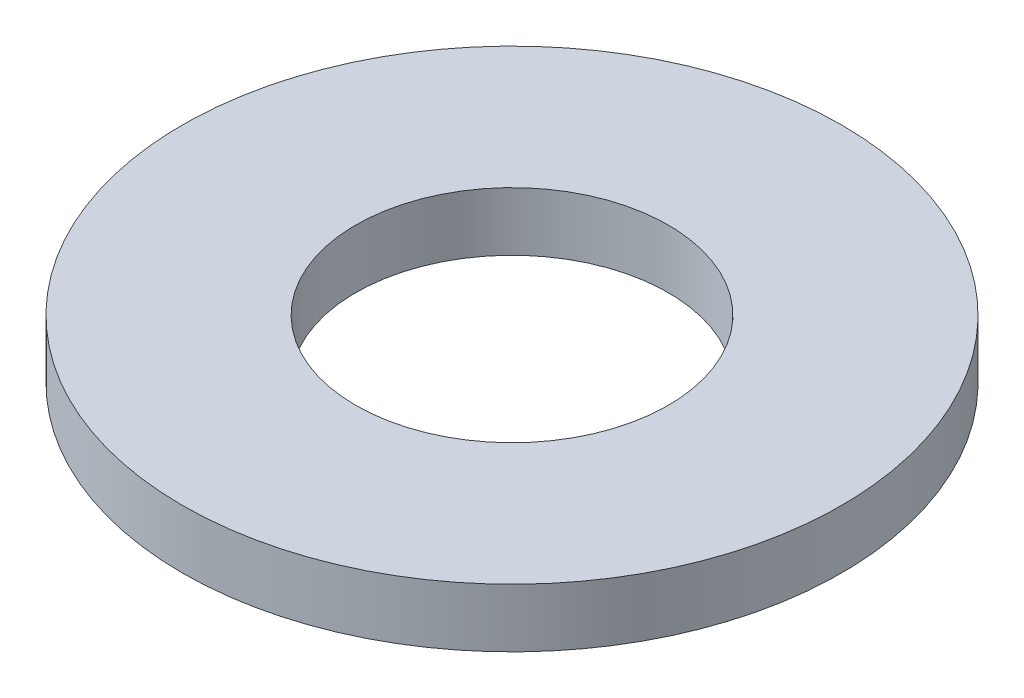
ISO-10303-21;
HEADER;
FILE_DESCRIPTION(('STEP AP214'),'2;1');
FILE_NAME('part.step','',(''),(''),'','','');
FILE_SCHEMA(('AUTOMOTIVE_DESIGN { 1 0 10303 214 1 1 1 1 }'));
ENDSEC;
DATA;
#1=APPLICATION_CONTEXT('core data for automotive mechanical design processes');
#2=APPLICATION_PROTOCOL_DEFINITION('international standard','automotive_design',2000,#1);
#3=PRODUCT_CONTEXT('',#1,'mechanical');
#4=PRODUCT('Part','Part','',(#3));
#5=PRODUCT_RELATED_PRODUCT_CATEGORY('part','',(#4));
#6=PRODUCT_DEFINITION_FORMATION('','',#4);
#7=PRODUCT_DEFINITION_CONTEXT('part definition',#1,'design');
#8=PRODUCT_DEFINITION('design','',#6,#7);
#9=PRODUCT_DEFINITION_SHAPE('','',#8);
#10=(LENGTH_UNIT() NAMED_UNIT(*) SI_UNIT(.MILLI.,.METRE.));
#11=(NAMED_UNIT(*) PLANE_ANGLE_UNIT() SI_UNIT($,.RADIAN.));
#12=(NAMED_UNIT(*) SI_UNIT($,.STERADIAN.) SOLID_ANGLE_UNIT());
#13=UNCERTAINTY_MEASURE_WITH_UNIT(LENGTH_MEASURE(1.E-05),#10,'distance_accuracy_value','');
#14=(GEOMETRIC_REPRESENTATION_CONTEXT(3) GLOBAL_UNCERTAINTY_ASSIGNED_CONTEXT((#13)) GLOBAL_UNIT_ASSIGNED_CONTEXT((#10,
#11,#12)) REPRESENTATION_CONTEXT('',''));
#15=CARTESIAN_POINT('',(0.,0.,0.));
#16=DIRECTION('',(0.,0.,1.));
#17=DIRECTION('',(1.,0.,0.));
#18=AXIS2_PLACEMENT_3D('',#15,#16,#17);
#19=CARTESIAN_POINT('',(0.,7.62,0.));
#20=DIRECTION('',(0.,-1.,0.));
#21=DIRECTION('',(0.,0.,-1.));
#22=AXIS2_PLACEMENT_3D('',#19,#20,#21);
#23=CYLINDRICAL_SURFACE('',#22,42.8625);
#24=CARTESIAN_POINT('',(0.,7.62,0.));
#25=DIRECTION('',(0.,1.,0.));
#26=DIRECTION('',(0.,0.,1.));
#27=AXIS2_PLACEMENT_3D('',#24,#25,#26);
#28=CIRCLE('',#27,42.8625);
#29=CARTESIAN_POINT('',(0.,7.62,-42.8625));
#30=VERTEX_POINT('',#29);
#31=EDGE_CURVE('E10',#30,#30,#28,.T.);
#32=CARTESIAN_POINT('',(0.,0.,0.));
#33=DIRECTION('',(0.,1.,0.));
#34=DIRECTION('',(0.,0.,1.));
#35=AXIS2_PLACEMENT_3D('',#32,#33,#34);
#36=CIRCLE('',#35,42.8625);
#37=CARTESIAN_POINT('',(0.,0.,-42.8625));
#38=VERTEX_POINT('',#37);
#39=EDGE_CURVE('E36',#38,#38,#36,.T.);
#40=CARTESIAN_POINT('',(0.,7.62,-42.8625));
#41=CARTESIAN_POINT('',(0.,7.540625,-42.8625));
#42=CARTESIAN_POINT('',(0.,7.46125,-42.8625));
#43=CARTESIAN_POINT('',(0.,7.3025,-42.8625));
#44=CARTESIAN_POINT('',(0.,7.223125,-42.8625));
#45=CARTESIAN_POINT('',(0.,7.064375,-42.8625));
#46=CARTESIAN_POINT('',(0.,6.985,-42.8625));
#47=CARTESIAN_POINT('',(0.,6.82625,-42.8625));
#48=CARTESIAN_POINT('',(0.,6.746875,-42.8625));
#49=CARTESIAN_POINT('',(0.,6.588125,-42.8625));
#50=CARTESIAN_POINT('',(0.,6.50875,-42.8625));
#51=CARTESIAN_POINT('',(0.,6.35,-42.8625));
#52=CARTESIAN_POINT('',(0.,6.270625,-42.8625));
#53=CARTESIAN_POINT('',(0.,6.111875,-42.8625));
#54=CARTESIAN_POINT('',(0.,6.0325,-42.8625));
#55=CARTESIAN_POINT('',(0.,5.87375,-42.8625));
#56=CARTESIAN_POINT('',(0.,5.794375,-42.8625));
#57=CARTESIAN_POINT('',(0.,5.635625,-42.8625));
#58=CARTESIAN_POINT('',(0.,5.55625,-42.8625));
#59=CARTESIAN_POINT('',(0.,5.3975,-42.8625));
#60=CARTESIAN_POINT('',(0.,5.318125,-42.8625));
#61=CARTESIAN_POINT('',(0.,5.159375,-42.8625));
#62=CARTESIAN_POINT('',(0.,5.08,-42.8625));
#63=CARTESIAN_POINT('',(0.,4.92125,-42.8625));
#64=CARTESIAN_POINT('',(0.,4.841875,-42.8625));
#65=CARTESIAN_POINT('',(0.,4.683125,-42.8625));
#66=CARTESIAN_POINT('',(0.,4.60375,-42.8625));
#67=CARTESIAN_POINT('',(0.,4.445,-42.8625));
#68=CARTESIAN_POINT('',(0.,4.365625,-42.8625));
#69=CARTESIAN_POINT('',(0.,4.206875,-42.8625));
#70=CARTESIAN_POINT('',(0.,4.1275,-42.8625));
#71=CARTESIAN_POINT('',(0.,3.96875,-42.8625));
#72=CARTESIAN_POINT('',(0.,3.889375,-42.8625));
#73=CARTESIAN_POINT('',(0.,3.730625,-42.8625));
#74=CARTESIAN_POINT('',(0.,3.65125,-42.8625));
#75=CARTESIAN_POINT('',(0.,3.4925,-42.8625));
#76=CARTESIAN_POINT('',(0.,3.413125,-42.8625));
#77=CARTESIAN_POINT('',(0.,3.254375,-42.8625));
#78=CARTESIAN_POINT('',(0.,3.175,-42.8625));
#79=CARTESIAN_POINT('',(0.,3.01625,-42.8625));
#80=CARTESIAN_POINT('',(0.,2.936875,-42.8625));
#81=CARTESIAN_POINT('',(0.,2.778125,-42.8625));
#82=CARTESIAN_POINT('',(0.,2.69875,-42.8625));
#83=CARTESIAN_POINT('',(0.,2.54,-42.8625));
#84=CARTESIAN_POINT('',(0.,2.460625,-42.8625));
#85=CARTESIAN_POINT('',(0.,2.301875,-42.8625));
#86=CARTESIAN_POINT('',(0.,2.2225,-42.8625));
#87=CARTESIAN_POINT('',(0.,2.06375,-42.8625));
#88=CARTESIAN_POINT('',(0.,1.984375,-42.8625));
#89=CARTESIAN_POINT('',(0.,1.825625,-42.8625));
#90=CARTESIAN_POINT('',(0.,1.74625,-42.8625));
#91=CARTESIAN_POINT('',(0.,1.5875,-42.8625));
#92=CARTESIAN_POINT('',(0.,1.508125,-42.8625));
#93=CARTESIAN_POINT('',(0.,1.349375,-42.8625));
#94=CARTESIAN_POINT('',(0.,1.27,-42.8625));
#95=CARTESIAN_POINT('',(0.,1.11125,-42.8625));
#96=CARTESIAN_POINT('',(0.,1.031875,-42.8625));
#97=CARTESIAN_POINT('',(0.,0.873125,-42.8625));
#98=CARTESIAN_POINT('',(0.,0.79375,-42.8625));
#99=CARTESIAN_POINT('',(0.,0.635,-42.8625));
#100=CARTESIAN_POINT('',(0.,0.555625,-42.8625));
#101=CARTESIAN_POINT('',(0.,0.396875,-42.8625));
#102=CARTESIAN_POINT('',(0.,0.3175,-42.8625));
#103=CARTESIAN_POINT('',(0.,0.15875,-42.8625));
#104=CARTESIAN_POINT('',(0.,0.0793749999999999,-42.8625));
#105=CARTESIAN_POINT('',(0.,0.,-42.8625));
#106=B_SPLINE_CURVE_WITH_KNOTS('',3,(#40,#41,#42,#43,#44,#45,#46,#47,#48,#49,#50,#51,#52,#53,
#54,#55,#56,#57,#58,#59,#60,#61,#62,#63,#64,#65,#66,#67,#68,#69,#70,#71,#72,#73,#74,#75,#76,#77,
#78,#79,#80,#81,#82,#83,#84,#85,#86,#87,#88,#89,#90,#91,#92,#93,#94,#95,#96,#97,#98,#99,#100,
#101,#102,#103,#104,#105),.UNSPECIFIED.,.F.,.F.,(4,2,2,2,2,2,2,2,2,2,2,2,2,2,2,2,2,2,2,2,2,2,2,
2,2,2,2,2,2,2,2,2,4),(0.,0.238125,0.47625,0.714375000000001,0.9525,1.190625,1.42875,1.666875,
1.905,2.143125,2.38125,2.619375,2.8575,3.095625,3.33375,3.571875,3.81,4.048125,4.28625,4.524375,
4.7625,5.000625,5.23875,5.476875,5.715,5.953125,6.19125,6.429375,6.6675,6.905625,7.14375,
7.381875,7.62),.UNSPECIFIED.);
#107=EDGE_CURVE('BSEAM33',#30,#38,#106,.T.);
#108=ORIENTED_EDGE('',*,*,#31,.F.);
#109=ORIENTED_EDGE('',*,*,#39,.T.);
#110=ORIENTED_EDGE('',*,*,#107,.T.);
#111=ORIENTED_EDGE('',*,*,#107,.F.);
#112=EDGE_LOOP('',(#108,#110,#109,#111));
#113=FACE_BOUND('',#112,.T.);
#114=ADVANCED_FACE('F33',(#113),#23,.T.);
#115=CARTESIAN_POINT('',(0.,7.62,0.));
#116=DIRECTION('',(0.,1.,0.));
#117=DIRECTION('',(0.,0.,1.));
#118=AXIS2_PLACEMENT_3D('',#115,#116,#117);
#119=PLANE('',#118);
#120=CARTESIAN_POINT('',(0.,7.62,0.));
#121=DIRECTION('',(0.,1.,0.));
#122=DIRECTION('',(0.,0.,1.));
#123=AXIS2_PLACEMENT_3D('',#120,#121,#122);
#124=CIRCLE('',#123,20.32);
#125=CARTESIAN_POINT('',(0.,7.62,20.32));
#126=VERTEX_POINT('',#125);
#127=EDGE_CURVE('E43',#126,#126,#124,.F.);
#128=ORIENTED_EDGE('',*,*,#127,.T.);
#129=EDGE_LOOP('',(#128));
#130=FACE_BOUND('',#129,.T.);
#131=ORIENTED_EDGE('',*,*,#31,.T.);
#132=EDGE_LOOP('',(#131));
#133=FACE_BOUND('',#132,.T.);
#134=ADVANCED_FACE('F61',(#130,#133),#119,.T.);
#135=CARTESIAN_POINT('',(0.,0.,0.));
#136=DIRECTION('',(0.,1.,0.));
#137=DIRECTION('',(0.,0.,1.));
#138=AXIS2_PLACEMENT_3D('',#135,#136,#137);
#139=PLANE('',#138);
#140=CARTESIAN_POINT('',(0.,0.,0.));
#141=DIRECTION('',(0.,1.,0.));
#142=DIRECTION('',(0.,0.,1.));
#143=AXIS2_PLACEMENT_3D('',#140,#141,#142);
#144=CIRCLE('',#143,20.32);
#145=CARTESIAN_POINT('',(0.,0.,20.32));
#146=VERTEX_POINT('',#145);
#147=EDGE_CURVE('E47',#146,#146,#144,.T.);
#148=ORIENTED_EDGE('',*,*,#147,.T.);
#149=EDGE_LOOP('',(#148));
#150=FACE_BOUND('',#149,.T.);
#151=ORIENTED_EDGE('',*,*,#39,.F.);
#152=EDGE_LOOP('',(#151));
#153=FACE_BOUND('',#152,.T.);
#154=ADVANCED_FACE('F51',(#150,#153),#139,.F.);
#155=CARTESIAN_POINT('',(0.,101.6,0.));
#156=DIRECTION('',(0.,-1.,0.));
#157=DIRECTION('',(0.,0.,-1.));
#158=AXIS2_PLACEMENT_3D('',#155,#156,#157);
#159=CYLINDRICAL_SURFACE('',#158,20.32);
#160=ORIENTED_EDGE('',*,*,#127,.F.);
#161=EDGE_LOOP('',(#160));
#162=FACE_BOUND('',#161,.T.);
#163=ORIENTED_EDGE('',*,*,#147,.F.);
#164=EDGE_LOOP('',(#163));
#165=FACE_BOUND('',#164,.T.);
#166=ADVANCED_FACE('F54',(#162,#165),#159,.F.);
#167=CLOSED_SHELL('',(#114,#134,#154,#166));
#168=MANIFOLD_SOLID_BREP('B2',#167);
#169=ADVANCED_BREP_SHAPE_REPRESENTATION('',(#18,#168),#14);
#170=SHAPE_DEFINITION_REPRESENTATION(#9,#169);
ENDSEC;
END-ISO-10303-21;
